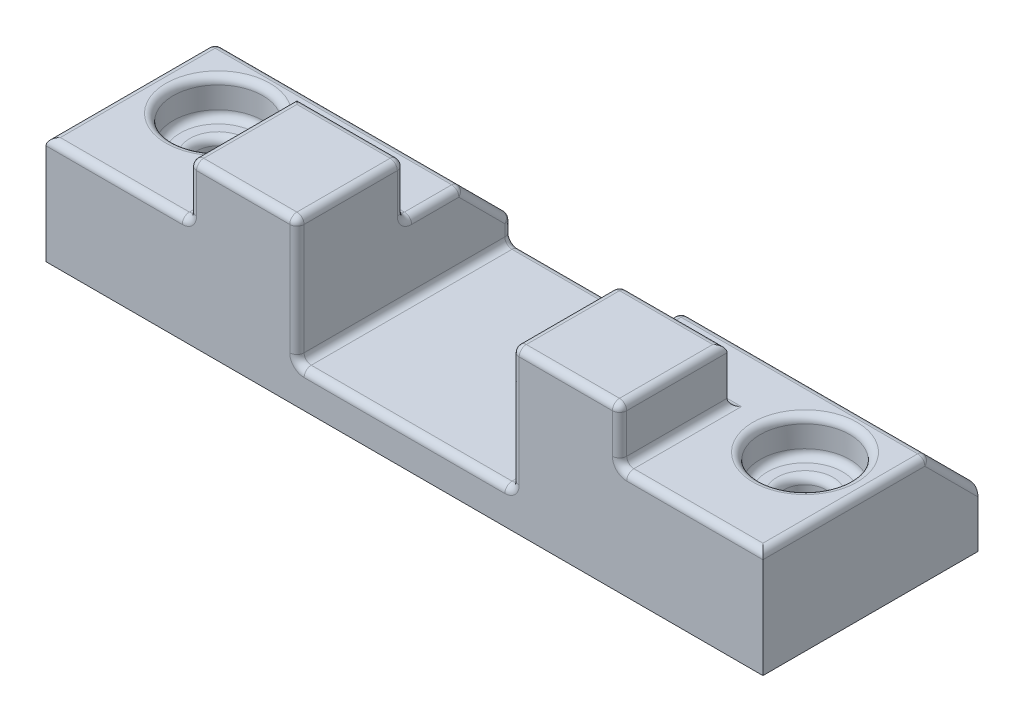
from build123d import *

# Parameters (mm, degrees)
SKETCH1_W          = 200
SKETCH1_H          = 30
EXTRUDE1_DEPTH     = 60
SKETCH2_W          = 60
SKETCH2_H          = 60
CUT_EXTRUDE1_DEPTH = 20
SKETCH3_W          = 30
SKETCH3_H          = 30
EXTRUDE2_DEPTH     = 15
SKETCH5_R          = 12.5
CUT_EXTRUDE2_DEPTH = 10
SKETCH6_R          = 5.834100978
CUT_EXTRUDE3_DEPTH = 211.297408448
CHAMFER1_SIZE      = 14
FILLET2_R          = 2
FILLET3_R          = 2
FILLET4_R          = 2


with BuildPart() as part:
    # Sketch1 → Extrude1 (new body)
    with BuildSketch(Plane.XY):
        with Locations((100, -15)):
            Rectangle(SKETCH1_W, SKETCH1_H)
    extrude(amount=EXTRUDE1_DEPTH)

    # Sketch2 → Cut-Extrude1 (cut)
    with BuildSketch(Plane(origin=(0, 0, 0), x_dir=(-1, 0, 0), z_dir=(0, 1, 0))):
        with Locations((-100, 30)):
            Rectangle(SKETCH2_W, SKETCH2_H)
    extrude(amount=-CUT_EXTRUDE1_DEPTH, mode=Mode.SUBTRACT)

    # Sketch3 → Extrude2 (add)
    with BuildSketch(Plane(origin=(0, 0, 0), x_dir=(-1, 0, 0), z_dir=(0, 1, 0))):
        with Locations((-145, 45)):
            Rectangle(SKETCH3_W, SKETCH3_H)
        with Locations((-55, 45)):
            Rectangle(SKETCH3_W, SKETCH3_H)
    extrude(amount=EXTRUDE2_DEPTH)

    # Sketch5 → Cut-Extrude2 (cut)
    with BuildSketch(Plane(origin=(0, 0, 0), x_dir=(-1, 0, 0), z_dir=(0, 1, 0))):
        with Locations(Location((-181.879194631, 30.140369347, 0), (0, 0, 90))):
            Circle(SKETCH5_R)
        with Locations(Location((-18.120805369, 30.140369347, 0), (0, 0, 270))):
            Circle(SKETCH5_R)
    extrude(amount=-CUT_EXTRUDE2_DEPTH, mode=Mode.SUBTRACT)

    # Sketch6 → Cut-Extrude3 (cut, through all)
    with BuildSketch(Plane(origin=(0, -10, 0), x_dir=(-1, 0, 0), z_dir=(0, 1, 0))):
        with Locations(Location((-181.879194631, 30.140369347, 0), (0, 0, 90))):
            Circle(SKETCH6_R)
        with Locations(Location((-18.120805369, 30.140369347, 0), (0, 0, 270))):
            Circle(SKETCH6_R)
    extrude(amount=-CUT_EXTRUDE3_DEPTH, mode=Mode.SUBTRACT)

    # Chamfer1
    chamfer1_edges = [part.edges().sort_by_distance(p)[0] for p in [
        (35, 0, 0),
        (165, 0, 0),
    ]]
    chamfer(chamfer1_edges, length=CHAMFER1_SIZE)

    # Fillet2
    fillet2_edges = [part.edges().sort_by_distance(p)[0] for p in [
        (181.879194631, -10, 17.640369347),
        (181.879194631, 0, 17.640369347),
        (18.120805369, -10, 42.640369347),
        (18.120805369, 0, 42.640369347),
        (181.879194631, -10, 24.306268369),
        (18.120805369, -10, 35.974470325),
    ]]
    fillet(fillet2_edges, radius=FILLET2_R)

    # Fillet3
    fillet3_edges = [part.edges().sort_by_distance(p)[0] for p in [
        (180, 0, 60),
        (130, -20, 30),
        (130, -17, 0),
        (100, -20, 60),
        (130, -2.5, 60),
        (70, -20, 30),
        (70, -2.5, 60),
        (100, -20, 0),
        (70, -17, 0),
        (130, 0, 22),
        (130, 7.5, 30),
        (160, 0, 45),
        (160, 7.5, 60),
        (145, 0, 30),
        (130, 15, 45),
        (145, 15, 60),
        (160, 15, 45),
        (145, 15, 30),
        (20, 0, 60),
        (55, 0, 30),
        (70, 7.5, 30),
        (40, 0, 45),
        (40, 7.5, 60),
        (70, 15, 45),
        (55, 15, 30),
        (40, 15, 45),
        (55, 15, 60),
        (70, 0, 22),
        (35, 0, 14),
        (0, -7, 7),
        (165, -14, 0),
        (0, 0, 37),
        (35, -14, 0),
        (70, -7, 7),
        (200, 0, 37),
        (165, 0, 14),
        (130, -7, 7),
        (200, -7, 7),
    ]]
    fillet(fillet3_edges, radius=FILLET3_R)

    # Fillet4
    fillet4_edges = [part.edges().sort_by_distance(p)[0] for p in [
        (181.879194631, -30, 24.306268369),
        (18.120805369, -30, 35.974470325),
    ]]
    fillet(fillet4_edges, radius=FILLET4_R)


solid = part.part
